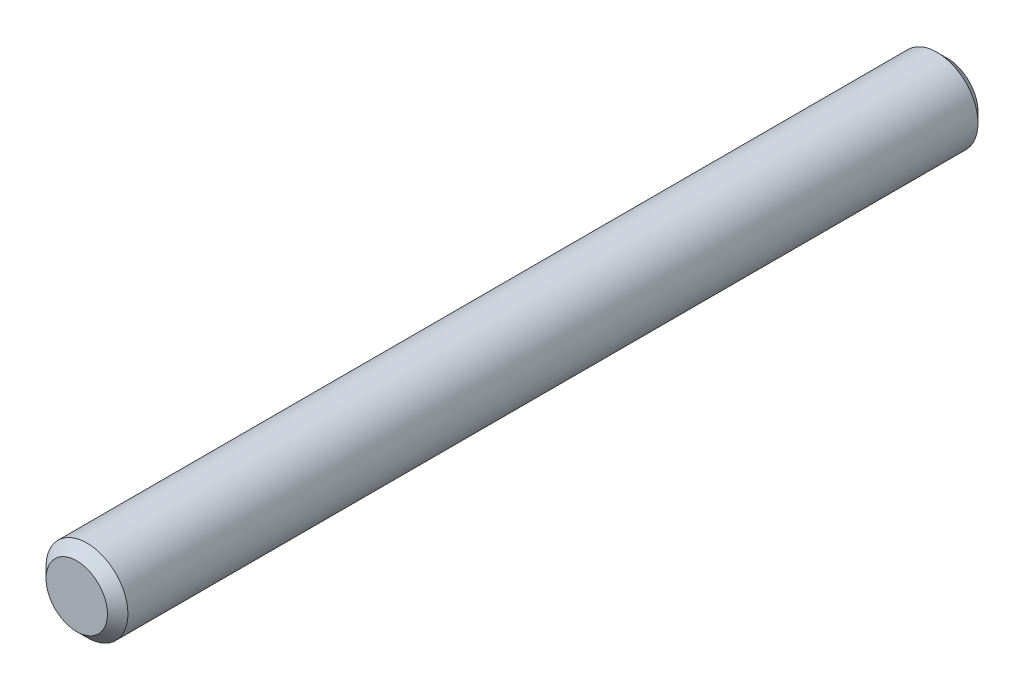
from build123d import *

# Parameters (mm, degrees)
ESQUISSE1_R      = 8
EXTRUSION1_DEPTH = 85
CHANFREIN1_SIZE  = 2


with BuildPart() as part:
    # Esquisse1 → Extrusion1 (new, symmetric)
    with BuildSketch(Plane.XY):
        Circle(ESQUISSE1_R)
    extrude(amount=EXTRUSION1_DEPTH, both=True)

    # Chanfrein1
    chanfrein1_edges = [part.edges().sort_by_distance(p)[0] for p in [
        (-8, 0, -85),
        (-8, 0, 85),
    ]]
    chamfer(chanfrein1_edges, length=CHANFREIN1_SIZE)


solid = part.part
